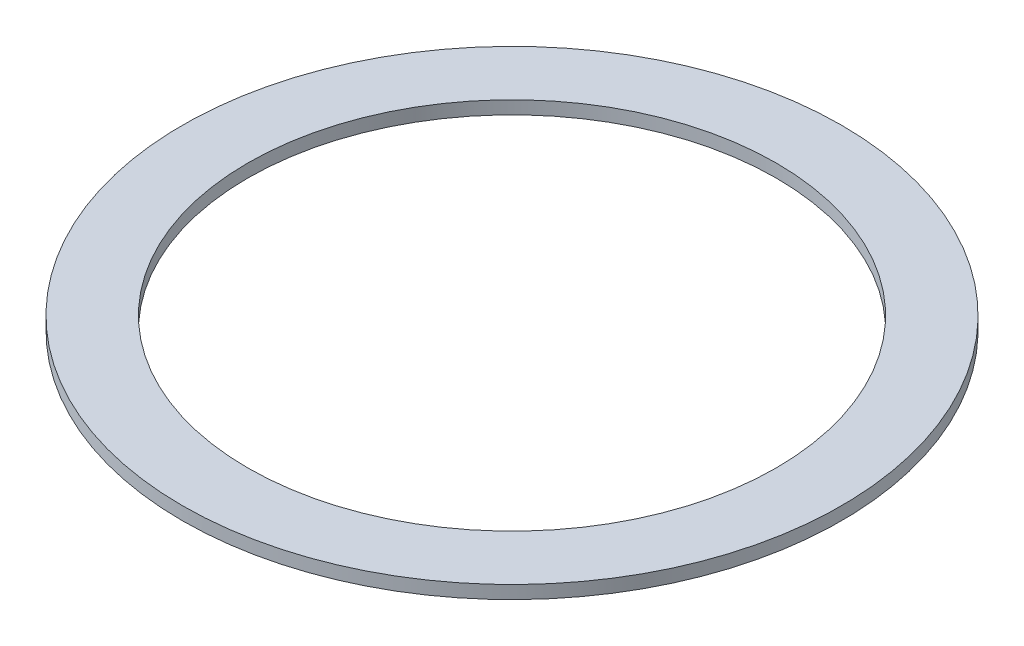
from build123d import *

# Parameters (mm, degrees)
SKETCH_1_R      = 50.4
SKETCH_1_R_2    = 40.4
EXTRUDE_1_DEPTH = 2


with BuildPart() as part:
    # Sketch 1 → Extrude 1 (new body)
    with BuildSketch(Plane(origin=(0, 0, 0), x_dir=(1, 0, 0), z_dir=(0, 1, 0))):
        with Locations(Location((0, 0, 0), (0, 0, 270))):
            Circle(SKETCH_1_R)
        with Locations(Location((0, 0, 0), (0, 0, 270))):
            Circle(SKETCH_1_R_2, mode=Mode.SUBTRACT)
    extrude(amount=EXTRUDE_1_DEPTH)


solid = part.part
